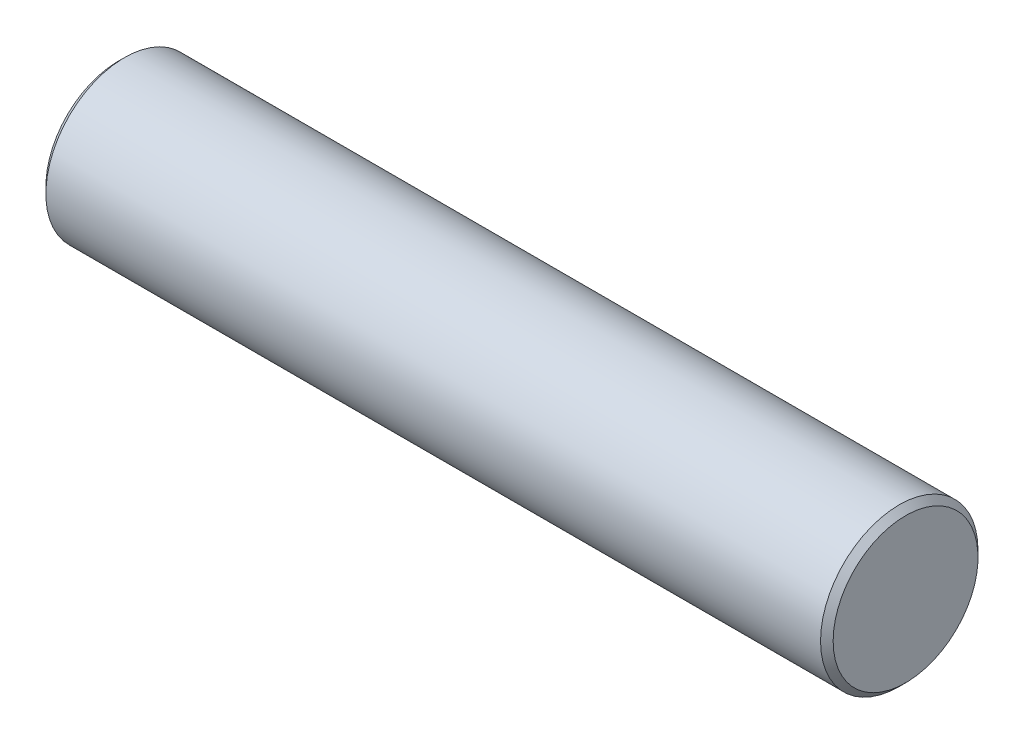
ISO-10303-21;
HEADER;
FILE_DESCRIPTION(('STEP AP214'),'2;1');
FILE_NAME('part.step','',(''),(''),'','','');
FILE_SCHEMA(('AUTOMOTIVE_DESIGN { 1 0 10303 214 1 1 1 1 }'));
ENDSEC;
DATA;
#1=APPLICATION_CONTEXT('core data for automotive mechanical design processes');
#2=APPLICATION_PROTOCOL_DEFINITION('international standard','automotive_design',2000,#1);
#3=PRODUCT_CONTEXT('',#1,'mechanical');
#4=PRODUCT('Part','Part','',(#3));
#5=PRODUCT_RELATED_PRODUCT_CATEGORY('part','',(#4));
#6=PRODUCT_DEFINITION_FORMATION('','',#4);
#7=PRODUCT_DEFINITION_CONTEXT('part definition',#1,'design');
#8=PRODUCT_DEFINITION('design','',#6,#7);
#9=PRODUCT_DEFINITION_SHAPE('','',#8);
#10=(LENGTH_UNIT() NAMED_UNIT(*) SI_UNIT(.MILLI.,.METRE.));
#11=(NAMED_UNIT(*) PLANE_ANGLE_UNIT() SI_UNIT($,.RADIAN.));
#12=(NAMED_UNIT(*) SI_UNIT($,.STERADIAN.) SOLID_ANGLE_UNIT());
#13=UNCERTAINTY_MEASURE_WITH_UNIT(LENGTH_MEASURE(1.E-05),#10,'distance_accuracy_value','');
#14=(GEOMETRIC_REPRESENTATION_CONTEXT(3) GLOBAL_UNCERTAINTY_ASSIGNED_CONTEXT((#13)) GLOBAL_UNIT_ASSIGNED_CONTEXT((#10,
#11,#12)) REPRESENTATION_CONTEXT('',''));
#15=CARTESIAN_POINT('',(0.,0.,0.));
#16=DIRECTION('',(0.,0.,1.));
#17=DIRECTION('',(1.,0.,0.));
#18=AXIS2_PLACEMENT_3D('',#15,#16,#17);
#19=CARTESIAN_POINT('',(0.,0.,0.));
#20=DIRECTION('',(1.,0.,0.));
#21=DIRECTION('',(0.,0.,-1.));
#22=AXIS2_PLACEMENT_3D('',#19,#20,#21);
#23=PLANE('',#22);
#24=CARTESIAN_POINT('',(-5.6843418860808E-11,0.,0.));
#25=DIRECTION('',(1.,0.,0.));
#26=DIRECTION('',(0.,0.,-1.));
#27=AXIS2_PLACEMENT_3D('',#24,#25,#26);
#28=CIRCLE('',#27,2.29999999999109);
#29=CARTESIAN_POINT('',(-5.6843418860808E-11,0.,-2.29999999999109));
#30=VERTEX_POINT('',#29);
#31=EDGE_CURVE('E17',#30,#30,#28,.T.);
#32=ORIENTED_EDGE('',*,*,#31,.F.);
#33=EDGE_LOOP('',(#32));
#34=FACE_BOUND('',#33,.T.);
#35=ADVANCED_FACE('F14',(#34),#23,.F.);
#36=CARTESIAN_POINT('',(25.,0.,0.));
#37=DIRECTION('',(1.,0.,0.));
#38=DIRECTION('',(0.,0.,-1.));
#39=AXIS2_PLACEMENT_3D('',#36,#37,#38);
#40=PLANE('',#39);
#41=CARTESIAN_POINT('',(24.9999999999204,0.,0.));
#42=DIRECTION('',(-1.,0.,0.));
#43=DIRECTION('',(0.,0.,1.));
#44=AXIS2_PLACEMENT_3D('',#41,#42,#43);
#45=CIRCLE('',#44,2.30000000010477);
#46=CARTESIAN_POINT('',(24.9999999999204,0.,2.30000000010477));
#47=VERTEX_POINT('',#46);
#48=EDGE_CURVE('E26',#47,#47,#45,.T.);
#49=ORIENTED_EDGE('',*,*,#48,.F.);
#50=EDGE_LOOP('',(#49));
#51=FACE_BOUND('',#50,.T.);
#52=ADVANCED_FACE('F37',(#51),#40,.T.);
#53=CARTESIAN_POINT('',(0.200000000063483,0.,0.));
#54=DIRECTION('',(1.,0.,0.));
#55=DIRECTION('',(0.,0.,-1.));
#56=AXIS2_PLACEMENT_3D('',#53,#54,#55);
#57=CONICAL_SURFACE('',#56,2.50000000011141,0.785398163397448);
#58=CARTESIAN_POINT('',(0.199999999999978,0.,0.));
#59=DIRECTION('',(1.,0.,0.));
#60=DIRECTION('',(0.,0.,-1.));
#61=AXIS2_PLACEMENT_3D('',#58,#59,#60);
#62=CIRCLE('',#61,2.5);
#63=CARTESIAN_POINT('',(0.199999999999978,0.,-2.5));
#64=VERTEX_POINT('',#63);
#65=EDGE_CURVE('E21',#64,#64,#62,.T.);
#66=ORIENTED_EDGE('',*,*,#65,.F.);
#67=EDGE_LOOP('',(#66));
#68=FACE_BOUND('',#67,.T.);
#69=ORIENTED_EDGE('',*,*,#31,.T.);
#70=EDGE_LOOP('',(#69));
#71=FACE_BOUND('',#70,.T.);
#72=ADVANCED_FACE('F34',(#68,#71),#57,.T.);
#73=CARTESIAN_POINT('',(24.7999999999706,0.,0.));
#74=DIRECTION('',(-1.,0.,0.));
#75=DIRECTION('',(0.,0.,1.));
#76=AXIS2_PLACEMENT_3D('',#73,#74,#75);
#77=CONICAL_SURFACE('',#76,2.49999999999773,0.785398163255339);
#78=CARTESIAN_POINT('',(24.7999999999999,0.,0.));
#79=DIRECTION('',(1.,0.,0.));
#80=DIRECTION('',(0.,0.,-1.));
#81=AXIS2_PLACEMENT_3D('',#78,#79,#80);
#82=CIRCLE('',#81,2.5);
#83=CARTESIAN_POINT('',(24.7999999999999,0.,-2.5));
#84=VERTEX_POINT('',#83);
#85=EDGE_CURVE('E10',#84,#84,#82,.F.);
#86=ORIENTED_EDGE('',*,*,#85,.F.);
#87=EDGE_LOOP('',(#86));
#88=FACE_BOUND('',#87,.T.);
#89=ORIENTED_EDGE('',*,*,#48,.T.);
#90=EDGE_LOOP('',(#89));
#91=FACE_BOUND('',#90,.T.);
#92=ADVANCED_FACE('F45',(#88,#91),#77,.T.);
#93=CARTESIAN_POINT('',(-1.24999999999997,0.,0.));
#94=DIRECTION('',(1.,0.,0.));
#95=DIRECTION('',(0.,0.,-1.));
#96=AXIS2_PLACEMENT_3D('',#93,#94,#95);
#97=CYLINDRICAL_SURFACE('',#96,2.5);
#98=ORIENTED_EDGE('',*,*,#85,.T.);
#99=EDGE_LOOP('',(#98));
#100=FACE_BOUND('',#99,.T.);
#101=ORIENTED_EDGE('',*,*,#65,.T.);
#102=EDGE_LOOP('',(#101));
#103=FACE_BOUND('',#102,.T.);
#104=ADVANCED_FACE('F43',(#100,#103),#97,.T.);
#105=CLOSED_SHELL('',(#35,#52,#72,#92,#104));
#106=MANIFOLD_SOLID_BREP('B1',#105);
#107=ADVANCED_BREP_SHAPE_REPRESENTATION('',(#18,#106),#14);
#108=SHAPE_DEFINITION_REPRESENTATION(#9,#107);
ENDSEC;
END-ISO-10303-21;
